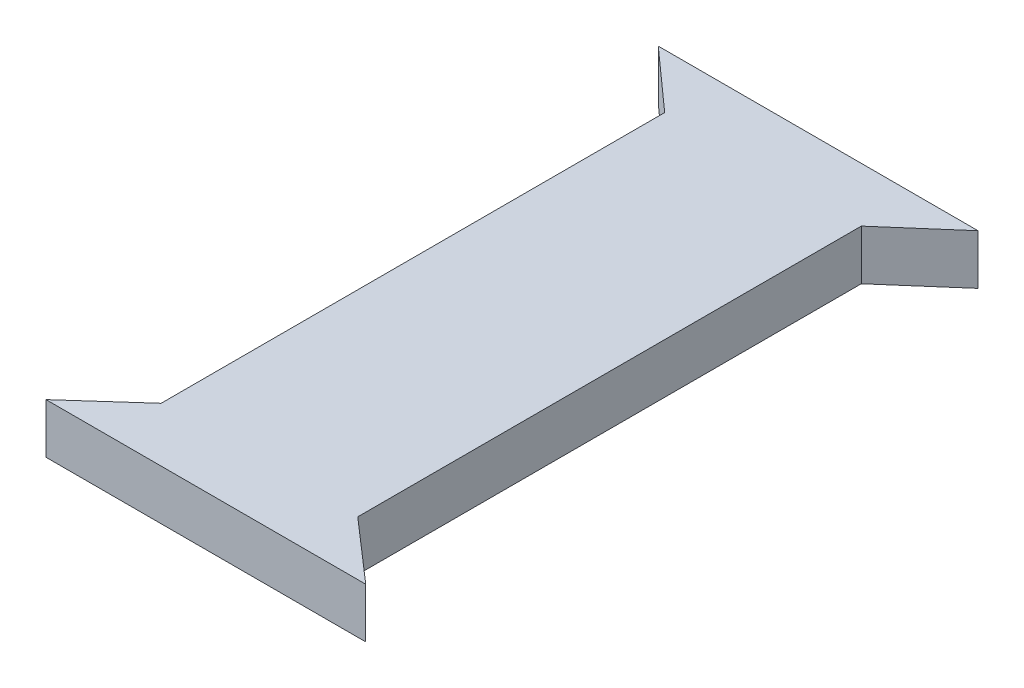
ISO-10303-21;
HEADER;
FILE_DESCRIPTION(('STEP AP214'),'2;1');
FILE_NAME('part.step','',(''),(''),'','','');
FILE_SCHEMA(('AUTOMOTIVE_DESIGN { 1 0 10303 214 1 1 1 1 }'));
ENDSEC;
DATA;
#1=APPLICATION_CONTEXT('core data for automotive mechanical design processes');
#2=APPLICATION_PROTOCOL_DEFINITION('international standard','automotive_design',2000,#1);
#3=PRODUCT_CONTEXT('',#1,'mechanical');
#4=PRODUCT('Part','Part','',(#3));
#5=PRODUCT_RELATED_PRODUCT_CATEGORY('part','',(#4));
#6=PRODUCT_DEFINITION_FORMATION('','',#4);
#7=PRODUCT_DEFINITION_CONTEXT('part definition',#1,'design');
#8=PRODUCT_DEFINITION('design','',#6,#7);
#9=PRODUCT_DEFINITION_SHAPE('','',#8);
#10=(LENGTH_UNIT() NAMED_UNIT(*) SI_UNIT(.MILLI.,.METRE.));
#11=(NAMED_UNIT(*) PLANE_ANGLE_UNIT() SI_UNIT($,.RADIAN.));
#12=(NAMED_UNIT(*) SI_UNIT($,.STERADIAN.) SOLID_ANGLE_UNIT());
#13=UNCERTAINTY_MEASURE_WITH_UNIT(LENGTH_MEASURE(1.E-05),#10,'distance_accuracy_value','');
#14=(GEOMETRIC_REPRESENTATION_CONTEXT(3) GLOBAL_UNCERTAINTY_ASSIGNED_CONTEXT((#13)) GLOBAL_UNIT_ASSIGNED_CONTEXT((#10,
#11,#12)) REPRESENTATION_CONTEXT('',''));
#15=CARTESIAN_POINT('',(0.,0.,0.));
#16=DIRECTION('',(0.,0.,1.));
#17=DIRECTION('',(1.,0.,0.));
#18=AXIS2_PLACEMENT_3D('',#15,#16,#17);
#19=CARTESIAN_POINT('',(40.2,12.5,76.6));
#20=DIRECTION('',(-0.657135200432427,0.,0.753772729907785));
#21=DIRECTION('',(0.753772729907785,0.,0.657135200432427));
#22=AXIS2_PLACEMENT_3D('',#19,#20,#21);
#23=PLANE('',#22);
#24=DIRECTION('',(-0.753772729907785,0.,-0.657135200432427));
#25=VECTOR('',#24,1.);
#26=CARTESIAN_POINT('',(40.2,0.,76.6));
#27=LINE('',#26,#25);
#28=CARTESIAN_POINT('',(40.2,0.,76.6));
#29=VERTEX_POINT('',#28);
#30=CARTESIAN_POINT('',(24.6,0.,63.));
#31=VERTEX_POINT('',#30);
#32=EDGE_CURVE('E128',#29,#31,#27,.T.);
#33=ORIENTED_EDGE('',*,*,#32,.T.);
#34=DIRECTION('',(0.,-1.,0.));
#35=VECTOR('',#34,1.);
#36=CARTESIAN_POINT('',(24.6,12.5,63.));
#37=LINE('',#36,#35);
#38=CARTESIAN_POINT('',(24.6,12.5,63.));
#39=VERTEX_POINT('',#38);
#40=EDGE_CURVE('E11',#39,#31,#37,.T.);
#41=ORIENTED_EDGE('',*,*,#40,.F.);
#42=DIRECTION('',(-0.753772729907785,0.,-0.657135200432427));
#43=VECTOR('',#42,1.);
#44=CARTESIAN_POINT('',(40.2,12.5,76.6));
#45=LINE('',#44,#43);
#46=CARTESIAN_POINT('',(40.2,12.5,76.6));
#47=VERTEX_POINT('',#46);
#48=EDGE_CURVE('E142',#47,#39,#45,.T.);
#49=ORIENTED_EDGE('',*,*,#48,.F.);
#50=DIRECTION('',(0.,-1.,0.));
#51=VECTOR('',#50,1.);
#52=CARTESIAN_POINT('',(40.2,12.5,76.6));
#53=LINE('',#52,#51);
#54=EDGE_CURVE('E124',#47,#29,#53,.T.);
#55=ORIENTED_EDGE('',*,*,#54,.T.);
#56=EDGE_LOOP('',(#33,#41,#49,#55));
#57=FACE_BOUND('',#56,.T.);
#58=ADVANCED_FACE('F32',(#57),#23,.F.);
#59=CARTESIAN_POINT('',(24.6,12.5,-63.));
#60=DIRECTION('',(-1.,0.,0.));
#61=DIRECTION('',(0.,0.,1.));
#62=AXIS2_PLACEMENT_3D('',#59,#60,#61);
#63=PLANE('',#62);
#64=DIRECTION('',(0.,0.,-1.));
#65=VECTOR('',#64,1.);
#66=CARTESIAN_POINT('',(24.6,0.,-63.));
#67=LINE('',#66,#65);
#68=CARTESIAN_POINT('',(24.6,0.,-63.));
#69=VERTEX_POINT('',#68);
#70=EDGE_CURVE('E131',#31,#69,#67,.T.);
#71=ORIENTED_EDGE('',*,*,#70,.T.);
#72=DIRECTION('',(0.,-1.,0.));
#73=VECTOR('',#72,1.);
#74=CARTESIAN_POINT('',(24.6,12.5,-63.));
#75=LINE('',#74,#73);
#76=CARTESIAN_POINT('',(24.6,12.5,-63.));
#77=VERTEX_POINT('',#76);
#78=EDGE_CURVE('E40',#77,#69,#75,.T.);
#79=ORIENTED_EDGE('',*,*,#78,.F.);
#80=DIRECTION('',(0.,0.,-1.));
#81=VECTOR('',#80,1.);
#82=CARTESIAN_POINT('',(24.6,12.5,-63.));
#83=LINE('',#82,#81);
#84=EDGE_CURVE('E91',#39,#77,#83,.T.);
#85=ORIENTED_EDGE('',*,*,#84,.F.);
#86=ORIENTED_EDGE('',*,*,#40,.T.);
#87=EDGE_LOOP('',(#71,#79,#85,#86));
#88=FACE_BOUND('',#87,.T.);
#89=ADVANCED_FACE('F177',(#88),#63,.F.);
#90=CARTESIAN_POINT('',(40.2,12.5,-76.6));
#91=DIRECTION('',(-0.657135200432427,0.,-0.753772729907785));
#92=DIRECTION('',(-0.753772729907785,0.,0.657135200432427));
#93=AXIS2_PLACEMENT_3D('',#90,#91,#92);
#94=PLANE('',#93);
#95=DIRECTION('',(0.753772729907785,0.,-0.657135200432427));
#96=VECTOR('',#95,1.);
#97=CARTESIAN_POINT('',(40.2,0.,-76.6));
#98=LINE('',#97,#96);
#99=CARTESIAN_POINT('',(40.2,0.,-76.6));
#100=VERTEX_POINT('',#99);
#101=EDGE_CURVE('E133',#69,#100,#98,.T.);
#102=ORIENTED_EDGE('',*,*,#101,.T.);
#103=DIRECTION('',(0.,-1.,0.));
#104=VECTOR('',#103,1.);
#105=CARTESIAN_POINT('',(40.2,12.5,-76.6));
#106=LINE('',#105,#104);
#107=CARTESIAN_POINT('',(40.2,12.5,-76.6));
#108=VERTEX_POINT('',#107);
#109=EDGE_CURVE('E149',#108,#100,#106,.T.);
#110=ORIENTED_EDGE('',*,*,#109,.F.);
#111=DIRECTION('',(0.753772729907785,0.,-0.657135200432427));
#112=VECTOR('',#111,1.);
#113=CARTESIAN_POINT('',(40.2,12.5,-76.6));
#114=LINE('',#113,#112);
#115=EDGE_CURVE('E157',#77,#108,#114,.T.);
#116=ORIENTED_EDGE('',*,*,#115,.F.);
#117=ORIENTED_EDGE('',*,*,#78,.T.);
#118=EDGE_LOOP('',(#102,#110,#116,#117));
#119=FACE_BOUND('',#118,.T.);
#120=ADVANCED_FACE('F155',(#119),#94,.F.);
#121=CARTESIAN_POINT('',(-39.8,12.5,-76.6));
#122=DIRECTION('',(0.,0.,1.));
#123=DIRECTION('',(1.,0.,0.));
#124=AXIS2_PLACEMENT_3D('',#121,#122,#123);
#125=PLANE('',#124);
#126=DIRECTION('',(-1.,0.,0.));
#127=VECTOR('',#126,1.);
#128=CARTESIAN_POINT('',(-39.8,0.,-76.6));
#129=LINE('',#128,#127);
#130=CARTESIAN_POINT('',(-39.8,0.,-76.6));
#131=VERTEX_POINT('',#130);
#132=EDGE_CURVE('E135',#100,#131,#129,.T.);
#133=ORIENTED_EDGE('',*,*,#132,.T.);
#134=DIRECTION('',(0.,-1.,0.));
#135=VECTOR('',#134,1.);
#136=CARTESIAN_POINT('',(-39.8,12.5,-76.6));
#137=LINE('',#136,#135);
#138=CARTESIAN_POINT('',(-39.8,12.5,-76.6));
#139=VERTEX_POINT('',#138);
#140=EDGE_CURVE('E146',#139,#131,#137,.T.);
#141=ORIENTED_EDGE('',*,*,#140,.F.);
#142=DIRECTION('',(-1.,0.,0.));
#143=VECTOR('',#142,1.);
#144=CARTESIAN_POINT('',(-39.8,12.5,-76.6));
#145=LINE('',#144,#143);
#146=EDGE_CURVE('E169',#108,#139,#145,.T.);
#147=ORIENTED_EDGE('',*,*,#146,.F.);
#148=ORIENTED_EDGE('',*,*,#109,.T.);
#149=EDGE_LOOP('',(#133,#141,#147,#148));
#150=FACE_BOUND('',#149,.T.);
#151=ADVANCED_FACE('F165',(#150),#125,.F.);
#152=CARTESIAN_POINT('',(-24.6,12.5,-63.));
#153=DIRECTION('',(0.666794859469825,0.,-0.7452413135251));
#154=DIRECTION('',(-0.7452413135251,0.,-0.666794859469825));
#155=AXIS2_PLACEMENT_3D('',#152,#153,#154);
#156=PLANE('',#155);
#157=DIRECTION('',(0.7452413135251,0.,0.666794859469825));
#158=VECTOR('',#157,1.);
#159=CARTESIAN_POINT('',(-24.6,0.,-63.));
#160=LINE('',#159,#158);
#161=CARTESIAN_POINT('',(-24.6,0.,-63.));
#162=VERTEX_POINT('',#161);
#163=EDGE_CURVE('E137',#131,#162,#160,.T.);
#164=ORIENTED_EDGE('',*,*,#163,.T.);
#165=DIRECTION('',(0.,-1.,0.));
#166=VECTOR('',#165,1.);
#167=CARTESIAN_POINT('',(-24.6,12.5,-63.));
#168=LINE('',#167,#166);
#169=CARTESIAN_POINT('',(-24.6,12.5,-63.));
#170=VERTEX_POINT('',#169);
#171=EDGE_CURVE('E119',#170,#162,#168,.T.);
#172=ORIENTED_EDGE('',*,*,#171,.F.);
#173=DIRECTION('',(0.7452413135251,0.,0.666794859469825));
#174=VECTOR('',#173,1.);
#175=CARTESIAN_POINT('',(-24.6,12.5,-63.));
#176=LINE('',#175,#174);
#177=EDGE_CURVE('E110',#139,#170,#176,.T.);
#178=ORIENTED_EDGE('',*,*,#177,.F.);
#179=ORIENTED_EDGE('',*,*,#140,.T.);
#180=EDGE_LOOP('',(#164,#172,#178,#179));
#181=FACE_BOUND('',#180,.T.);
#182=ADVANCED_FACE('F168',(#181),#156,.F.);
#183=CARTESIAN_POINT('',(-24.6,12.5,-63.));
#184=DIRECTION('',(1.,0.,0.));
#185=DIRECTION('',(0.,0.,-1.));
#186=AXIS2_PLACEMENT_3D('',#183,#184,#185);
#187=PLANE('',#186);
#188=DIRECTION('',(0.,0.,1.));
#189=VECTOR('',#188,1.);
#190=CARTESIAN_POINT('',(-24.6,0.,-63.));
#191=LINE('',#190,#189);
#192=CARTESIAN_POINT('',(-24.6,0.,63.));
#193=VERTEX_POINT('',#192);
#194=EDGE_CURVE('E118',#162,#193,#191,.T.);
#195=ORIENTED_EDGE('',*,*,#194,.T.);
#196=DIRECTION('',(0.,-1.,0.));
#197=VECTOR('',#196,1.);
#198=CARTESIAN_POINT('',(-24.6,12.5,63.));
#199=LINE('',#198,#197);
#200=CARTESIAN_POINT('',(-24.6,12.5,63.));
#201=VERTEX_POINT('',#200);
#202=EDGE_CURVE('E115',#201,#193,#199,.T.);
#203=ORIENTED_EDGE('',*,*,#202,.F.);
#204=DIRECTION('',(0.,0.,1.));
#205=VECTOR('',#204,1.);
#206=CARTESIAN_POINT('',(-24.6,12.5,-63.));
#207=LINE('',#206,#205);
#208=EDGE_CURVE('E104',#170,#201,#207,.T.);
#209=ORIENTED_EDGE('',*,*,#208,.F.);
#210=ORIENTED_EDGE('',*,*,#171,.T.);
#211=EDGE_LOOP('',(#195,#203,#209,#210));
#212=FACE_BOUND('',#211,.T.);
#213=ADVANCED_FACE('F116',(#212),#187,.F.);
#214=CARTESIAN_POINT('',(-24.6,12.5,63.));
#215=DIRECTION('',(0.666794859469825,0.,0.7452413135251));
#216=DIRECTION('',(0.7452413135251,0.,-0.666794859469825));
#217=AXIS2_PLACEMENT_3D('',#214,#215,#216);
#218=PLANE('',#217);
#219=DIRECTION('',(-0.7452413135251,0.,0.666794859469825));
#220=VECTOR('',#219,1.);
#221=CARTESIAN_POINT('',(-24.6,0.,63.));
#222=LINE('',#221,#220);
#223=CARTESIAN_POINT('',(-39.8,0.,76.6));
#224=VERTEX_POINT('',#223);
#225=EDGE_CURVE('E77',#193,#224,#222,.T.);
#226=ORIENTED_EDGE('',*,*,#225,.T.);
#227=DIRECTION('',(0.,-1.,0.));
#228=VECTOR('',#227,1.);
#229=CARTESIAN_POINT('',(-39.8,12.5,76.6));
#230=LINE('',#229,#228);
#231=CARTESIAN_POINT('',(-39.8,12.5,76.6));
#232=VERTEX_POINT('',#231);
#233=EDGE_CURVE('E120',#232,#224,#230,.T.);
#234=ORIENTED_EDGE('',*,*,#233,.F.);
#235=DIRECTION('',(-0.7452413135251,0.,0.666794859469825));
#236=VECTOR('',#235,1.);
#237=CARTESIAN_POINT('',(-24.6,12.5,63.));
#238=LINE('',#237,#236);
#239=EDGE_CURVE('E108',#201,#232,#238,.T.);
#240=ORIENTED_EDGE('',*,*,#239,.F.);
#241=ORIENTED_EDGE('',*,*,#202,.T.);
#242=EDGE_LOOP('',(#226,#234,#240,#241));
#243=FACE_BOUND('',#242,.T.);
#244=ADVANCED_FACE('F122',(#243),#218,.F.);
#245=CARTESIAN_POINT('',(-39.8,12.5,76.6));
#246=DIRECTION('',(0.,0.,-1.));
#247=DIRECTION('',(-1.,0.,0.));
#248=AXIS2_PLACEMENT_3D('',#245,#246,#247);
#249=PLANE('',#248);
#250=DIRECTION('',(1.,0.,0.));
#251=VECTOR('',#250,1.);
#252=CARTESIAN_POINT('',(-39.8,0.,76.6));
#253=LINE('',#252,#251);
#254=EDGE_CURVE('E83',#224,#29,#253,.T.);
#255=ORIENTED_EDGE('',*,*,#254,.T.);
#256=ORIENTED_EDGE('',*,*,#54,.F.);
#257=DIRECTION('',(1.,0.,0.));
#258=VECTOR('',#257,1.);
#259=CARTESIAN_POINT('',(-39.8,12.5,76.6));
#260=LINE('',#259,#258);
#261=EDGE_CURVE('E48',#232,#47,#260,.T.);
#262=ORIENTED_EDGE('',*,*,#261,.F.);
#263=ORIENTED_EDGE('',*,*,#233,.T.);
#264=EDGE_LOOP('',(#255,#256,#262,#263));
#265=FACE_BOUND('',#264,.T.);
#266=ADVANCED_FACE('F193',(#265),#249,.F.);
#267=CARTESIAN_POINT('',(0.,12.5,0.));
#268=DIRECTION('',(0.,1.,0.));
#269=DIRECTION('',(0.,0.,1.));
#270=AXIS2_PLACEMENT_3D('',#267,#268,#269);
#271=PLANE('',#270);
#272=ORIENTED_EDGE('',*,*,#48,.T.);
#273=ORIENTED_EDGE('',*,*,#84,.T.);
#274=ORIENTED_EDGE('',*,*,#115,.T.);
#275=ORIENTED_EDGE('',*,*,#146,.T.);
#276=ORIENTED_EDGE('',*,*,#177,.T.);
#277=ORIENTED_EDGE('',*,*,#208,.T.);
#278=ORIENTED_EDGE('',*,*,#239,.T.);
#279=ORIENTED_EDGE('',*,*,#261,.T.);
#280=EDGE_LOOP('',(#272,#273,#274,#275,#276,#277,#278,#279));
#281=FACE_BOUND('',#280,.T.);
#282=ADVANCED_FACE('F106',(#281),#271,.T.);
#283=CARTESIAN_POINT('',(0.,0.,0.));
#284=DIRECTION('',(0.,1.,0.));
#285=DIRECTION('',(0.,0.,1.));
#286=AXIS2_PLACEMENT_3D('',#283,#284,#285);
#287=PLANE('',#286);
#288=ORIENTED_EDGE('',*,*,#32,.F.);
#289=ORIENTED_EDGE('',*,*,#254,.F.);
#290=ORIENTED_EDGE('',*,*,#225,.F.);
#291=ORIENTED_EDGE('',*,*,#194,.F.);
#292=ORIENTED_EDGE('',*,*,#163,.F.);
#293=ORIENTED_EDGE('',*,*,#132,.F.);
#294=ORIENTED_EDGE('',*,*,#101,.F.);
#295=ORIENTED_EDGE('',*,*,#70,.F.);
#296=EDGE_LOOP('',(#288,#289,#290,#291,#292,#293,#294,#295));
#297=FACE_BOUND('',#296,.T.);
#298=ADVANCED_FACE('F161',(#297),#287,.F.);
#299=CLOSED_SHELL('',(#58,#89,#120,#151,#182,#213,#244,#266,#282,#298));
#300=MANIFOLD_SOLID_BREP('B2',#299);
#301=ADVANCED_BREP_SHAPE_REPRESENTATION('',(#18,#300),#14);
#302=SHAPE_DEFINITION_REPRESENTATION(#9,#301);
ENDSEC;
END-ISO-10303-21;
